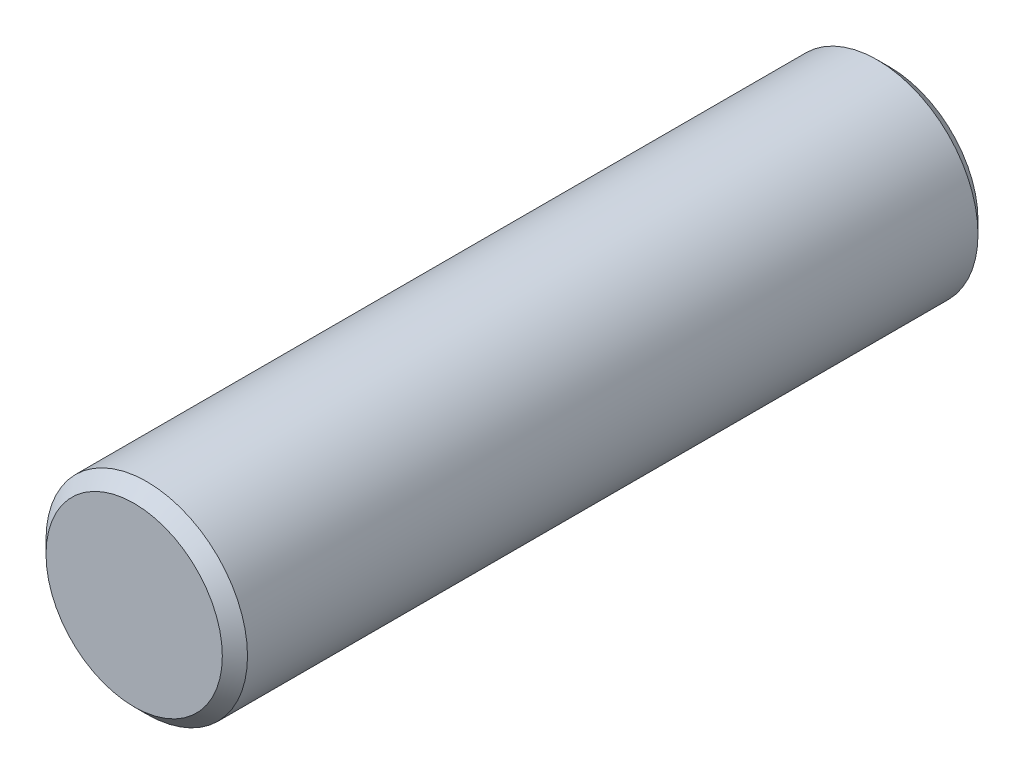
from build123d import *

# Parameters (mm, degrees)
ESQUISSE1_R          = 8
BASE_EXTRUSION_DEPTH = 60
CHANFREIN1_SIZE      = 1


with BuildPart() as part:
    # Esquisse1 → Base-Extrusion (new body)
    with BuildSketch(Plane.XY):
        Circle(ESQUISSE1_R)
    extrude(amount=BASE_EXTRUSION_DEPTH)

    # Chanfrein1
    chanfrein1_edges = [part.edges().sort_by_distance(p)[0] for p in [
        (-8, 0, 0),
        (-8, 0, 60),
    ]]
    chamfer(chanfrein1_edges, length=CHANFREIN1_SIZE)


solid = part.part
